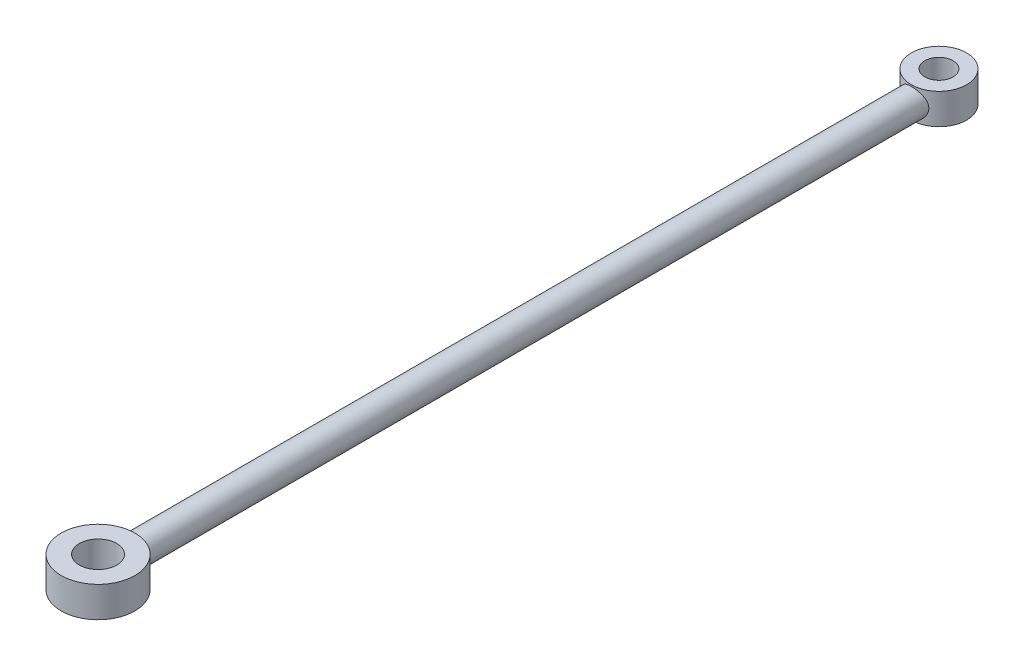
ISO-10303-21;
HEADER;
FILE_DESCRIPTION(('STEP AP214'),'2;1');
FILE_NAME('part.step','',(''),(''),'','','');
FILE_SCHEMA(('AUTOMOTIVE_DESIGN { 1 0 10303 214 1 1 1 1 }'));
ENDSEC;
DATA;
#1=APPLICATION_CONTEXT('core data for automotive mechanical design processes');
#2=APPLICATION_PROTOCOL_DEFINITION('international standard','automotive_design',2000,#1);
#3=PRODUCT_CONTEXT('',#1,'mechanical');
#4=PRODUCT('Part','Part','',(#3));
#5=PRODUCT_RELATED_PRODUCT_CATEGORY('part','',(#4));
#6=PRODUCT_DEFINITION_FORMATION('','',#4);
#7=PRODUCT_DEFINITION_CONTEXT('part definition',#1,'design');
#8=PRODUCT_DEFINITION('design','',#6,#7);
#9=PRODUCT_DEFINITION_SHAPE('','',#8);
#10=(LENGTH_UNIT() NAMED_UNIT(*) SI_UNIT(.MILLI.,.METRE.));
#11=(NAMED_UNIT(*) PLANE_ANGLE_UNIT() SI_UNIT($,.RADIAN.));
#12=(NAMED_UNIT(*) SI_UNIT($,.STERADIAN.) SOLID_ANGLE_UNIT());
#13=UNCERTAINTY_MEASURE_WITH_UNIT(LENGTH_MEASURE(1.E-05),#10,'distance_accuracy_value','');
#14=(GEOMETRIC_REPRESENTATION_CONTEXT(3) GLOBAL_UNCERTAINTY_ASSIGNED_CONTEXT((#13)) GLOBAL_UNIT_ASSIGNED_CONTEXT((#10,
#11,#12)) REPRESENTATION_CONTEXT('',''));
#15=CARTESIAN_POINT('',(0.,0.,0.));
#16=DIRECTION('',(0.,0.,1.));
#17=DIRECTION('',(1.,0.,0.));
#18=AXIS2_PLACEMENT_3D('',#15,#16,#17);
#19=CARTESIAN_POINT('',(0.,5.,0.));
#20=DIRECTION('',(0.,-1.,0.));
#21=DIRECTION('',(0.,0.,-1.));
#22=AXIS2_PLACEMENT_3D('',#19,#20,#21);
#23=CYLINDRICAL_SURFACE('',#22,6.);
#24=CARTESIAN_POINT('',(-2.25000000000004,2.5,-5.56214886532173));
#25=CARTESIAN_POINT('',(-2.2500045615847,2.62151122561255,-5.56214460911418));
#26=CARTESIAN_POINT('',(-2.24012396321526,2.74299238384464,-5.56617390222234));
#27=CARTESIAN_POINT('',(-2.20104281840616,2.98229212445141,-5.58174238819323));
#28=CARTESIAN_POINT('',(-2.17184285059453,3.10011081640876,-5.59328135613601));
#29=CARTESIAN_POINT('',(-2.09534486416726,3.32856305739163,-5.62238220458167));
#30=CARTESIAN_POINT('',(-2.04809020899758,3.43921308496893,-5.6399296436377));
#31=CARTESIAN_POINT('',(-1.93697785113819,3.65105784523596,-5.67904701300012));
#32=CARTESIAN_POINT('',(-1.87311516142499,3.75224972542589,-5.7006181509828));
#33=CARTESIAN_POINT('',(-1.72719992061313,3.94733546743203,-5.74655362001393));
#34=CARTESIAN_POINT('',(-1.64445571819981,4.0406927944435,-5.77100012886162));
#35=CARTESIAN_POINT('',(-1.46459375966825,4.21258422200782,-5.81924625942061));
#36=CARTESIAN_POINT('',(-1.36747294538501,4.29111516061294,-5.8430457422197));
#37=CARTESIAN_POINT('',(-1.15754198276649,4.43370926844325,-5.88829310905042));
#38=CARTESIAN_POINT('',(-1.0443104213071,4.49718921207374,-5.90963341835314));
#39=CARTESIAN_POINT('',(-0.807833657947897,4.60397675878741,-5.94657011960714));
#40=CARTESIAN_POINT('',(-0.68459194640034,4.64729135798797,-5.96216850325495));
#41=CARTESIAN_POINT('',(-0.437234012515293,4.71063684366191,-5.98528045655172));
#42=CARTESIAN_POINT('',(-0.313384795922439,4.73159144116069,-5.99311372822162));
#43=CARTESIAN_POINT('',(-0.0636965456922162,4.75258180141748,-6.0009602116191));
#44=CARTESIAN_POINT('',(0.0621418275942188,4.75262436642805,-6.00097596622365));
#45=CARTESIAN_POINT('',(0.305615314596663,4.73232735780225,-5.9933889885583));
#46=CARTESIAN_POINT('',(0.423348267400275,4.71299605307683,-5.9861631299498));
#47=CARTESIAN_POINT('',(0.65375882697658,4.65619612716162,-5.96539912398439));
#48=CARTESIAN_POINT('',(0.766436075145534,4.61872622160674,-5.95186052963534));
#49=CARTESIAN_POINT('',(0.985483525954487,4.52624432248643,-5.91956653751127));
#50=CARTESIAN_POINT('',(1.09173808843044,4.47098499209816,-5.90073809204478));
#51=CARTESIAN_POINT('',(1.29372991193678,4.34471185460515,-5.85976965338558));
#52=CARTESIAN_POINT('',(1.38946376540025,4.27369296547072,-5.83762859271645));
#53=CARTESIAN_POINT('',(1.57363573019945,4.11305907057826,-5.79078794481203));
#54=CARTESIAN_POINT('',(1.66131921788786,4.02259912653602,-5.76601445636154));
#55=CARTESIAN_POINT('',(1.82055593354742,3.828110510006,-5.71773690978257));
#56=CARTESIAN_POINT('',(1.89210511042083,3.72407844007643,-5.69423317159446));
#57=CARTESIAN_POINT('',(2.01848417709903,3.50242079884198,-5.65069055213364));
#58=CARTESIAN_POINT('',(2.07290771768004,3.3845447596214,-5.63074015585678));
#59=CARTESIAN_POINT('',(2.16084696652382,3.14035566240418,-5.59758657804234));
#60=CARTESIAN_POINT('',(2.19437430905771,3.01404734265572,-5.58437964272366));
#61=CARTESIAN_POINT('',(2.2378528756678,2.76403605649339,-5.56709395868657));
#62=CARTESIAN_POINT('',(2.24900281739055,2.64057384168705,-5.56255177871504));
#63=CARTESIAN_POINT('',(2.25086828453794,2.39348596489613,-5.56179809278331));
#64=CARTESIAN_POINT('',(2.24158891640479,2.26986035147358,-5.56558450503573));
#65=CARTESIAN_POINT('',(2.20394600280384,2.0321051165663,-5.58059072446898));
#66=CARTESIAN_POINT('',(2.17650927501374,1.91780329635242,-5.5914491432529));
#67=CARTESIAN_POINT('',(2.10449661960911,1.69547808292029,-5.61894730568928));
#68=CARTESIAN_POINT('',(2.05991718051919,1.58745598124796,-5.63558823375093));
#69=CARTESIAN_POINT('',(1.95300438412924,1.37625334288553,-5.67354364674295));
#70=CARTESIAN_POINT('',(1.89006817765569,1.27340606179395,-5.69500993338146));
#71=CARTESIAN_POINT('',(1.74886976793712,1.07930652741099,-5.73994221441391));
#72=CARTESIAN_POINT('',(1.67060195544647,0.988058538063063,-5.76340893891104));
#73=CARTESIAN_POINT('',(1.49509101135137,0.813747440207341,-5.81149569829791));
#74=CARTESIAN_POINT('',(1.39695951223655,0.731569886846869,-5.83609454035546));
#75=CARTESIAN_POINT('',(1.18769620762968,0.584742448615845,-5.8822481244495));
#76=CARTESIAN_POINT('',(1.07656435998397,0.520092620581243,-5.90380285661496));
#77=CARTESIAN_POINT('',(0.844524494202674,0.410580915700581,-5.94142478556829));
#78=CARTESIAN_POINT('',(0.723651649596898,0.365651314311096,-5.95751072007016));
#79=CARTESIAN_POINT('',(0.47532283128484,0.297015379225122,-5.98244155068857));
#80=CARTESIAN_POINT('',(0.347869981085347,0.2732990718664,-5.99128984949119));
#81=CARTESIAN_POINT('',(0.0980033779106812,0.248838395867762,-6.0004261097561));
#82=CARTESIAN_POINT('',(-0.02427115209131,0.246835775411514,-6.00118291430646));
#83=CARTESIAN_POINT('',(-0.267340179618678,0.262622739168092,-5.99527334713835));
#84=CARTESIAN_POINT('',(-0.388134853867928,0.280409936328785,-5.98860787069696));
#85=CARTESIAN_POINT('',(-0.62182237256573,0.334388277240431,-5.96881634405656));
#86=CARTESIAN_POINT('',(-0.734836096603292,0.370119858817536,-5.95585187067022));
#87=CARTESIAN_POINT('',(-0.953273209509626,0.458515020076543,-5.92481675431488));
#88=CARTESIAN_POINT('',(-1.05869515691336,0.511181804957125,-5.90674514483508));
#89=CARTESIAN_POINT('',(-1.26381026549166,0.634470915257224,-5.86635927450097));
#90=CARTESIAN_POINT('',(-1.3630763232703,0.705754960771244,-5.84389860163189));
#91=CARTESIAN_POINT('',(-1.54862602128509,0.863211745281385,-5.79749261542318));
#92=CARTESIAN_POINT('',(-1.63490500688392,0.949389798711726,-5.77354677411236));
#93=CARTESIAN_POINT('',(-1.79671821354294,1.13959619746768,-5.72532194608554));
#94=CARTESIAN_POINT('',(-1.87144499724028,1.24432660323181,-5.70109208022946));
#95=CARTESIAN_POINT('',(-2.00227064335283,1.46562380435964,-5.65647487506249));
#96=CARTESIAN_POINT('',(-2.05836757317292,1.58219182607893,-5.63608793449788));
#97=CARTESIAN_POINT('',(-2.15198830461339,1.82943352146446,-5.60103404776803));
#98=CARTESIAN_POINT('',(-2.18859004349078,1.96050154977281,-5.58665704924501));
#99=CARTESIAN_POINT('',(-2.23758535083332,2.22772790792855,-5.56721991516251));
#100=CARTESIAN_POINT('',(-2.24999489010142,2.36388281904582,-5.56215363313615));
#101=CARTESIAN_POINT('',(-2.25000000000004,2.5,-5.56214886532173));
#102=B_SPLINE_CURVE_WITH_KNOTS('',3,(#24,#25,#26,#27,#28,#29,#30,#31,#32,#33,#34,#35,#36,#37,
#38,#39,#40,#41,#42,#43,#44,#45,#46,#47,#48,#49,#50,#51,#52,#53,#54,#55,#56,#57,#58,#59,#60,#61,
#62,#63,#64,#65,#66,#67,#68,#69,#70,#71,#72,#73,#74,#75,#76,#77,#78,#79,#80,#81,#82,#83,#84,#85,
#86,#87,#88,#89,#90,#91,#92,#93,#94,#95,#96,#97,#98,#99,#100,#101),.UNSPECIFIED.,.T.,.F.,(4,2,2,
2,2,2,2,2,2,2,2,2,2,2,2,2,2,2,2,2,2,2,2,2,2,2,2,2,2,2,2,2,2,2,2,2,2,2,4),(0.,0.364026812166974,
0.728042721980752,1.09118978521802,1.45444601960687,1.83411978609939,2.21387443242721,
2.60655108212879,2.99909139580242,3.37470027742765,3.75018698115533,4.10709709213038,
4.4640324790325,4.82616196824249,5.18840840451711,5.57185012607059,5.95538801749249,
6.34743888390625,6.73927127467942,7.10948486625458,7.47960593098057,7.83215768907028,
8.1847817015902,8.55062341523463,8.91659922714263,9.30577525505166,9.69495254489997,
10.0827826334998,10.4704302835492,10.8354858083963,11.2004973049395,11.5566041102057,
11.9127783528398,12.2839248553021,12.6552040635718,13.0460789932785,13.4369944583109,
13.8450476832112,14.2528314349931),.UNSPECIFIED.);
#103=CARTESIAN_POINT('',(-2.25000000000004,2.5,-5.56214886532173));
#104=VERTEX_POINT('',#103);
#105=EDGE_CURVE('E60',#104,#104,#102,.T.);
#106=ORIENTED_EDGE('',*,*,#105,.F.);
#107=EDGE_LOOP('',(#106));
#108=FACE_BOUND('',#107,.T.);
#109=CARTESIAN_POINT('',(0.,5.,0.));
#110=DIRECTION('',(0.,1.,0.));
#111=DIRECTION('',(0.,0.,1.));
#112=AXIS2_PLACEMENT_3D('',#109,#110,#111);
#113=CIRCLE('',#112,6.);
#114=CARTESIAN_POINT('',(0.,5.,6.));
#115=VERTEX_POINT('',#114);
#116=EDGE_CURVE('E10',#115,#115,#113,.T.);
#117=ORIENTED_EDGE('',*,*,#116,.F.);
#118=EDGE_LOOP('',(#117));
#119=FACE_BOUND('',#118,.T.);
#120=CARTESIAN_POINT('',(0.,0.,0.));
#121=DIRECTION('',(0.,1.,0.));
#122=DIRECTION('',(0.,0.,1.));
#123=AXIS2_PLACEMENT_3D('',#120,#121,#122);
#124=CIRCLE('',#123,6.);
#125=CARTESIAN_POINT('',(0.,0.,6.));
#126=VERTEX_POINT('',#125);
#127=EDGE_CURVE('E45',#126,#126,#124,.T.);
#128=ORIENTED_EDGE('',*,*,#127,.T.);
#129=EDGE_LOOP('',(#128));
#130=FACE_BOUND('',#129,.T.);
#131=ADVANCED_FACE('F42',(#108,#119,#130),#23,.T.);
#132=CARTESIAN_POINT('',(0.,5.,0.));
#133=DIRECTION('',(0.,1.,0.));
#134=DIRECTION('',(0.,0.,1.));
#135=AXIS2_PLACEMENT_3D('',#132,#133,#134);
#136=PLANE('',#135);
#137=CARTESIAN_POINT('',(0.,5.,0.));
#138=DIRECTION('',(0.,1.,0.));
#139=DIRECTION('',(0.,0.,1.));
#140=AXIS2_PLACEMENT_3D('',#137,#138,#139);
#141=CIRCLE('',#140,3.05);
#142=CARTESIAN_POINT('',(0.,5.,3.05));
#143=VERTEX_POINT('',#142);
#144=EDGE_CURVE('E56',#143,#143,#141,.T.);
#145=ORIENTED_EDGE('',*,*,#144,.F.);
#146=EDGE_LOOP('',(#145));
#147=FACE_BOUND('',#146,.T.);
#148=ORIENTED_EDGE('',*,*,#116,.T.);
#149=EDGE_LOOP('',(#148));
#150=FACE_BOUND('',#149,.T.);
#151=ADVANCED_FACE('F106',(#147,#150),#136,.T.);
#152=CARTESIAN_POINT('',(0.,0.,0.));
#153=DIRECTION('',(0.,1.,0.));
#154=DIRECTION('',(0.,0.,1.));
#155=AXIS2_PLACEMENT_3D('',#152,#153,#154);
#156=PLANE('',#155);
#157=CARTESIAN_POINT('',(0.,0.,0.));
#158=DIRECTION('',(0.,1.,0.));
#159=DIRECTION('',(0.,0.,1.));
#160=AXIS2_PLACEMENT_3D('',#157,#158,#159);
#161=CIRCLE('',#160,3.05);
#162=CARTESIAN_POINT('',(0.,0.,3.05));
#163=VERTEX_POINT('',#162);
#164=EDGE_CURVE('E54',#163,#163,#161,.T.);
#165=ORIENTED_EDGE('',*,*,#164,.T.);
#166=EDGE_LOOP('',(#165));
#167=FACE_BOUND('',#166,.T.);
#168=ORIENTED_EDGE('',*,*,#127,.F.);
#169=EDGE_LOOP('',(#168));
#170=FACE_BOUND('',#169,.T.);
#171=ADVANCED_FACE('F113',(#167,#170),#156,.F.);
#172=CARTESIAN_POINT('',(0.,0.,0.));
#173=DIRECTION('',(0.,1.,0.));
#174=DIRECTION('',(0.,0.,1.));
#175=AXIS2_PLACEMENT_3D('',#172,#173,#174);
#176=CYLINDRICAL_SURFACE('',#175,3.05);
#177=ORIENTED_EDGE('',*,*,#164,.F.);
#178=EDGE_LOOP('',(#177));
#179=FACE_BOUND('',#178,.T.);
#180=ORIENTED_EDGE('',*,*,#144,.T.);
#181=EDGE_LOOP('',(#180));
#182=FACE_BOUND('',#181,.T.);
#183=ADVANCED_FACE('F122',(#179,#182),#176,.F.);
#184=CARTESIAN_POINT('',(0.,2.5,6.002));
#185=DIRECTION('',(0.,0.,-1.));
#186=DIRECTION('',(-1.,0.,0.));
#187=AXIS2_PLACEMENT_3D('',#184,#185,#186);
#188=CYLINDRICAL_SURFACE('',#187,2.25);
#189=ORIENTED_EDGE('',*,*,#105,.T.);
#190=EDGE_LOOP('',(#189));
#191=FACE_BOUND('',#190,.T.);
#192=CARTESIAN_POINT('',(2.24999999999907,2.5,-133.10288568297));
#193=CARTESIAN_POINT('',(2.24999053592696,2.38276014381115,-133.102874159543));
#194=CARTESIAN_POINT('',(2.24077459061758,2.26536755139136,-133.097514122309));
#195=CARTESIAN_POINT('',(2.20437756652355,2.03418792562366,-133.076847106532));
#196=CARTESIAN_POINT('',(2.17715873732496,1.92040899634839,-133.061519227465));
#197=CARTESIAN_POINT('',(2.10622479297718,1.70023394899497,-133.023139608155));
#198=CARTESIAN_POINT('',(2.0625973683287,1.59380208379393,-133.000128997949));
#199=CARTESIAN_POINT('',(1.96035195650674,1.38979549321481,-132.949040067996));
#200=CARTESIAN_POINT('',(1.90173315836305,1.29222124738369,-132.920961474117));
#201=CARTESIAN_POINT('',(1.76549970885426,1.09981212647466,-132.860070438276));
#202=CARTESIAN_POINT('',(1.68671707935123,1.0058669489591,-132.827058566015));
#203=CARTESIAN_POINT('',(1.51482106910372,0.83183112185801,-132.761630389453));
#204=CARTESIAN_POINT('',(1.4217005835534,0.751747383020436,-132.729214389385));
#205=CARTESIAN_POINT('',(1.21610151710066,0.602423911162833,-132.666016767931));
#206=CARTESIAN_POINT('',(1.10274117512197,0.534279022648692,-132.635492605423));
#207=CARTESIAN_POINT('',(0.864353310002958,0.418433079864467,-132.582107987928));
#208=CARTESIAN_POINT('',(0.739333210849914,0.370719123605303,-132.559242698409));
#209=CARTESIAN_POINT('',(0.490601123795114,0.300614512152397,-132.525189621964));
#210=CARTESIAN_POINT('',(0.367429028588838,0.276663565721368,-132.513286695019));
#211=CARTESIAN_POINT('',(0.118283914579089,0.249626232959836,-132.499829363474));
#212=CARTESIAN_POINT('',(-0.00768736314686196,0.246527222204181,-132.498268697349));
#213=CARTESIAN_POINT('',(-0.24712317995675,0.260680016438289,-132.505332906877));
#214=CARTESIAN_POINT('',(-0.360722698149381,0.276185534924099,-132.513083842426));
#215=CARTESIAN_POINT('',(-0.583455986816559,0.323981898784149,-132.536579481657));
#216=CARTESIAN_POINT('',(-0.692589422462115,0.356274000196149,-132.552324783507));
#217=CARTESIAN_POINT('',(-0.905196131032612,0.436935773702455,-132.590639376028));
#218=CARTESIAN_POINT('',(-1.00857020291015,0.485521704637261,-132.613300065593));
#219=CARTESIAN_POINT('',(-1.20594780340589,0.597092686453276,-132.6634029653));
#220=CARTESIAN_POINT('',(-1.29994795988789,0.660082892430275,-132.690846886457));
#221=CARTESIAN_POINT('',(-1.4853907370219,0.805514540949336,-132.751001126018));
#222=CARTESIAN_POINT('',(-1.57575166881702,0.889231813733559,-132.783964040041));
#223=CARTESIAN_POINT('',(-1.74173483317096,1.07032688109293,-132.849777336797));
#224=CARTESIAN_POINT('',(-1.81734572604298,1.16771508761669,-132.882627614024));
#225=CARTESIAN_POINT('',(-1.95638700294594,1.38095843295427,-132.94675648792));
#226=CARTESIAN_POINT('',(-2.01873895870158,1.49759355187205,-132.97780280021));
#227=CARTESIAN_POINT('',(-2.12246800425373,1.74160976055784,-133.031552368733));
#228=CARTESIAN_POINT('',(-2.16386698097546,1.86897947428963,-133.054264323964));
#229=CARTESIAN_POINT('',(-2.22115547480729,2.1202326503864,-133.086245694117));
#230=CARTESIAN_POINT('',(-2.23880652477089,2.2435925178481,-133.096437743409));
#231=CARTESIAN_POINT('',(-2.25341312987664,2.49190301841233,-133.104846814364));
#232=CARTESIAN_POINT('',(-2.25038330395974,2.61685246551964,-133.103072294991));
#233=CARTESIAN_POINT('',(-2.22533109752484,2.85022131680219,-133.088727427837));
#234=CARTESIAN_POINT('',(-2.20542258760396,2.95895376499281,-133.077359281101));
#235=CARTESIAN_POINT('',(-2.15031664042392,3.17132751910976,-133.046884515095));
#236=CARTESIAN_POINT('',(-2.1151142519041,3.27496716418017,-133.027775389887));
#237=CARTESIAN_POINT('',(-2.02870707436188,3.47967549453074,-132.982935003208));
#238=CARTESIAN_POINT('',(-1.9768366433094,3.58040278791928,-132.956938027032));
#239=CARTESIAN_POINT('',(-1.85914589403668,3.77230586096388,-132.901487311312));
#240=CARTESIAN_POINT('',(-1.79331840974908,3.86347669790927,-132.87203179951));
#241=CARTESIAN_POINT('',(-1.63988362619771,4.04570222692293,-132.808520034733));
#242=CARTESIAN_POINT('',(-1.5505768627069,4.13529358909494,-132.774351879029));
#243=CARTESIAN_POINT('',(-1.35766011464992,4.29867753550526,-132.708479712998));
#244=CARTESIAN_POINT('',(-1.2540453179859,4.37246478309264,-132.676776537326));
#245=CARTESIAN_POINT('',(-1.03170456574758,4.50379088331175,-132.618319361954));
#246=CARTESIAN_POINT('',(-0.912651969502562,4.56084951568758,-132.591718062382));
#247=CARTESIAN_POINT('',(-0.664925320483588,4.6535602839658,-132.547624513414));
#248=CARTESIAN_POINT('',(-0.53625982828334,4.6892312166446,-132.530124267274));
#249=CARTESIAN_POINT('',(-0.285704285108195,4.73507926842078,-132.507481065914));
#250=CARTESIAN_POINT('',(-0.164275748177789,4.74729521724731,-132.50135162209));
#251=CARTESIAN_POINT('',(0.0790334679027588,4.75189735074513,-132.499052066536));
#252=CARTESIAN_POINT('',(0.200913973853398,4.74429047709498,-132.502878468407));
#253=CARTESIAN_POINT('',(0.433210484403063,4.71081307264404,-132.519485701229));
#254=CARTESIAN_POINT('',(0.543852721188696,4.68617904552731,-132.531659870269));
#255=CARTESIAN_POINT('',(0.759253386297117,4.62101429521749,-132.563177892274));
#256=CARTESIAN_POINT('',(0.864010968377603,4.58048129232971,-132.5825227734));
#257=CARTESIAN_POINT('',(1.06970268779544,4.48286396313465,-132.627666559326));
#258=CARTESIAN_POINT('',(1.17028166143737,4.42514587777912,-132.653706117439));
#259=CARTESIAN_POINT('',(1.36074285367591,4.29559530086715,-132.709516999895));
#260=CARTESIAN_POINT('',(1.45062012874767,4.2237563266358,-132.739290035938));
#261=CARTESIAN_POINT('',(1.62655688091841,4.05970378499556,-132.803106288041));
#262=CARTESIAN_POINT('',(1.71134624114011,3.96617404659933,-132.837279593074));
#263=CARTESIAN_POINT('',(1.8644909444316,3.76574624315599,-132.903580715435));
#264=CARTESIAN_POINT('',(1.93283174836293,3.65883647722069,-132.935706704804));
#265=CARTESIAN_POINT('',(2.05297554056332,3.43002749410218,-132.995009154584));
#266=CARTESIAN_POINT('',(2.10418765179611,3.30776135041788,-133.021997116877));
#267=CARTESIAN_POINT('',(2.16445420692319,3.11809961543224,-133.054667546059));
#268=CARTESIAN_POINT('',(2.18177624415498,3.05389620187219,-133.064250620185));
#269=CARTESIAN_POINT('',(2.21071578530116,2.92386337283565,-133.080431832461));
#270=CARTESIAN_POINT('',(2.22233727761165,2.85803512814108,-133.087032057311));
#271=CARTESIAN_POINT('',(2.23732049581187,2.7434491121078,-133.095585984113));
#272=CARTESIAN_POINT('',(2.24206978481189,2.69492531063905,-133.098315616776));
#273=CARTESIAN_POINT('',(2.24841161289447,2.59760984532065,-133.101967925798));
#274=CARTESIAN_POINT('',(2.25000394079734,2.54881816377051,-133.102890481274));
#275=CARTESIAN_POINT('',(2.24999999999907,2.5,-133.10288568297));
#276=B_SPLINE_CURVE_WITH_KNOTS('',3,(#192,#193,#194,#195,#196,#197,#198,#199,#200,#201,#202,
#203,#204,#205,#206,#207,#208,#209,#210,#211,#212,#213,#214,#215,#216,#217,#218,#219,#220,#221,
#222,#223,#224,#225,#226,#227,#228,#229,#230,#231,#232,#233,#234,#235,#236,#237,#238,#239,#240,
#241,#242,#243,#244,#245,#246,#247,#248,#249,#250,#251,#252,#253,#254,#255,#256,#257,#258,#259,
#260,#261,#262,#263,#264,#265,#266,#267,#268,#269,#270,#271,#272,#273,#274,#275),.UNSPECIFIED.,
.T.,.F.,(4,2,2,2,2,2,2,2,2,2,2,2,2,2,2,2,2,2,2,2,2,2,2,2,2,2,2,2,2,2,2,2,2,2,2,2,2,2,2,2,2,4),
(0.,0.351522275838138,0.703784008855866,1.05418934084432,1.40461363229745,1.7839402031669,
2.16345534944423,2.56855257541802,2.97339360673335,3.3494284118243,3.72523553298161,
4.06836219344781,4.41151453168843,4.75941453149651,5.10743923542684,5.4883618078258,
5.86957608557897,6.27499893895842,6.67999741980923,7.05290154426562,7.42554209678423,
7.75741912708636,8.08940367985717,8.43676416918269,8.78430343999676,9.1756517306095,
9.56713196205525,9.96894408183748,10.3704025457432,10.7350260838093,11.0995219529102,
11.4399995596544,11.7805260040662,12.135616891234,12.490871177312,12.8814804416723,
13.2724337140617,13.6757418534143,13.8770319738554,14.0781810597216,14.2245436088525,
14.3709159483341),.UNSPECIFIED.);
#277=CARTESIAN_POINT('',(2.24999999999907,2.5,-133.10288568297));
#278=VERTEX_POINT('',#277);
#279=EDGE_CURVE('E72',#278,#278,#276,.T.);
#280=ORIENTED_EDGE('',*,*,#279,.F.);
#281=EDGE_LOOP('',(#280));
#282=FACE_BOUND('',#281,.T.);
#283=ADVANCED_FACE('F79',(#191,#282),#188,.T.);
#284=CARTESIAN_POINT('',(0.,5.,-137.));
#285=DIRECTION('',(0.,-1.,0.));
#286=DIRECTION('',(0.,0.,-1.));
#287=AXIS2_PLACEMENT_3D('',#284,#285,#286);
#288=CYLINDRICAL_SURFACE('',#287,4.5);
#289=ORIENTED_EDGE('',*,*,#279,.T.);
#290=EDGE_LOOP('',(#289));
#291=FACE_BOUND('',#290,.T.);
#292=CARTESIAN_POINT('',(0.,5.,-137.));
#293=DIRECTION('',(0.,1.,0.));
#294=DIRECTION('',(0.,0.,1.));
#295=AXIS2_PLACEMENT_3D('',#292,#293,#294);
#296=CIRCLE('',#295,4.5);
#297=CARTESIAN_POINT('',(0.,5.,-132.5));
#298=VERTEX_POINT('',#297);
#299=EDGE_CURVE('E139',#298,#298,#296,.T.);
#300=ORIENTED_EDGE('',*,*,#299,.F.);
#301=EDGE_LOOP('',(#300));
#302=FACE_BOUND('',#301,.T.);
#303=CARTESIAN_POINT('',(0.,0.,-137.));
#304=DIRECTION('',(0.,1.,0.));
#305=DIRECTION('',(0.,0.,1.));
#306=AXIS2_PLACEMENT_3D('',#303,#304,#305);
#307=CIRCLE('',#306,4.5);
#308=CARTESIAN_POINT('',(0.,0.,-132.5));
#309=VERTEX_POINT('',#308);
#310=EDGE_CURVE('E142',#309,#309,#307,.T.);
#311=ORIENTED_EDGE('',*,*,#310,.T.);
#312=EDGE_LOOP('',(#311));
#313=FACE_BOUND('',#312,.T.);
#314=ADVANCED_FACE('F86',(#291,#302,#313),#288,.T.);
#315=CARTESIAN_POINT('',(0.,5.,-137.));
#316=DIRECTION('',(0.,1.,0.));
#317=DIRECTION('',(0.,0.,1.));
#318=AXIS2_PLACEMENT_3D('',#315,#316,#317);
#319=PLANE('',#318);
#320=CARTESIAN_POINT('',(0.,5.,-137.));
#321=DIRECTION('',(0.,1.,0.));
#322=DIRECTION('',(0.,0.,1.));
#323=AXIS2_PLACEMENT_3D('',#320,#321,#322);
#324=CIRCLE('',#323,2.3);
#325=CARTESIAN_POINT('',(0.,5.,-134.7));
#326=VERTEX_POINT('',#325);
#327=EDGE_CURVE('E150',#326,#326,#324,.T.);
#328=ORIENTED_EDGE('',*,*,#327,.F.);
#329=EDGE_LOOP('',(#328));
#330=FACE_BOUND('',#329,.T.);
#331=ORIENTED_EDGE('',*,*,#299,.T.);
#332=EDGE_LOOP('',(#331));
#333=FACE_BOUND('',#332,.T.);
#334=ADVANCED_FACE('F89',(#330,#333),#319,.T.);
#335=CARTESIAN_POINT('',(0.,0.,-137.));
#336=DIRECTION('',(0.,1.,0.));
#337=DIRECTION('',(0.,0.,1.));
#338=AXIS2_PLACEMENT_3D('',#335,#336,#337);
#339=PLANE('',#338);
#340=CARTESIAN_POINT('',(0.,0.,-137.));
#341=DIRECTION('',(0.,1.,0.));
#342=DIRECTION('',(0.,0.,1.));
#343=AXIS2_PLACEMENT_3D('',#340,#341,#342);
#344=CIRCLE('',#343,2.3);
#345=CARTESIAN_POINT('',(0.,0.,-134.7));
#346=VERTEX_POINT('',#345);
#347=EDGE_CURVE('E148',#346,#346,#344,.T.);
#348=ORIENTED_EDGE('',*,*,#347,.T.);
#349=EDGE_LOOP('',(#348));
#350=FACE_BOUND('',#349,.T.);
#351=ORIENTED_EDGE('',*,*,#310,.F.);
#352=EDGE_LOOP('',(#351));
#353=FACE_BOUND('',#352,.T.);
#354=ADVANCED_FACE('F91',(#350,#353),#339,.F.);
#355=CARTESIAN_POINT('',(0.,0.,-137.));
#356=DIRECTION('',(0.,1.,0.));
#357=DIRECTION('',(0.,0.,1.));
#358=AXIS2_PLACEMENT_3D('',#355,#356,#357);
#359=CYLINDRICAL_SURFACE('',#358,2.3);
#360=ORIENTED_EDGE('',*,*,#347,.F.);
#361=EDGE_LOOP('',(#360));
#362=FACE_BOUND('',#361,.T.);
#363=ORIENTED_EDGE('',*,*,#327,.T.);
#364=EDGE_LOOP('',(#363));
#365=FACE_BOUND('',#364,.T.);
#366=ADVANCED_FACE('F94',(#362,#365),#359,.F.);
#367=CLOSED_SHELL('',(#131,#151,#171,#183,#283,#314,#334,#354,#366));
#368=MANIFOLD_SOLID_BREP('B2',#367);
#369=ADVANCED_BREP_SHAPE_REPRESENTATION('',(#18,#368),#14);
#370=SHAPE_DEFINITION_REPRESENTATION(#9,#369);
ENDSEC;
END-ISO-10303-21;
